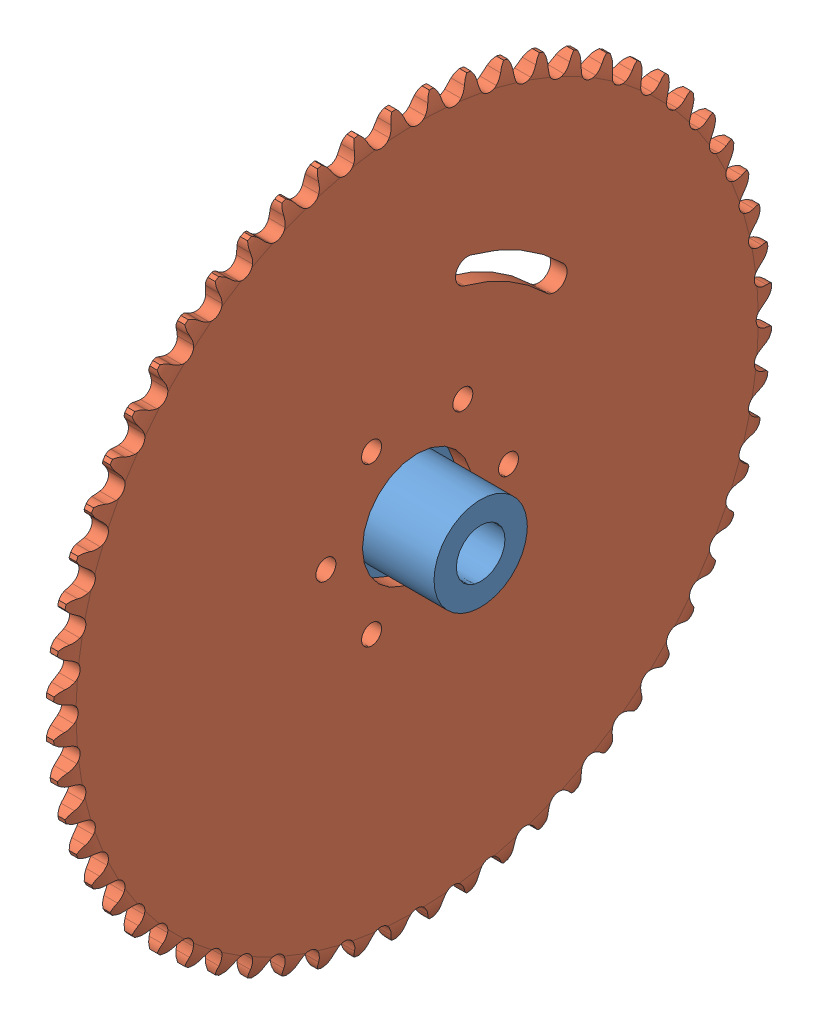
SolidWorks assembly Steering Arm Sprocket Assembly.SLDASM, configuration Default (file format 6000). Lengths in mm.
Overall size (25.4 256.04 256.04).
2 component instances, 2 part files, 3 mates.
Components (placement in the parent):
- .375 Hex Hub-1: .375 Hex Hub.SLDPRT [Default] at (0.3612 9.1791 -6.4268) size (25.4 60.96 60.96)
- 60t Sprocket-1: 60t Sprocket.SLDPRT [Default] at (-10.5355 9.1791 -6.4268) x (1 0 0) z (0 0.5 0.866025) size (4.91 187.43 187.43)
Mates (geometry in assembly coordinates):
- Coincident1: coincident anti-aligned: plane of .375 Hex Hub-1 through (-12.6738 39.6591 -6.4268) normal (1 0 0); plane of 60t Sprocket-1 through (-12.6738 47.7038 -28.669) normal (-1 0 0)
- Concentric1: concentric aligned: cylinder of .375 Hex Hub-1 through (8.1542 9.1791 -6.4268) axis (-1 0 0) radius 12.1666; cylinder of 60t Sprocket-1 through (252.4022 9.1791 -6.4268) axis (-1 0 0) radius 14.2812
- Concentric2: concentric anti-aligned: cylinder of .375 Hex Hub-1 through (-17.2458 9.1791 -30.2393) axis (-1 0 0) radius 2.5908; cylinder of 60t Sprocket-1 through (-273.2603 9.1791 -30.2393) axis (1 0 0) radius 2.6162
